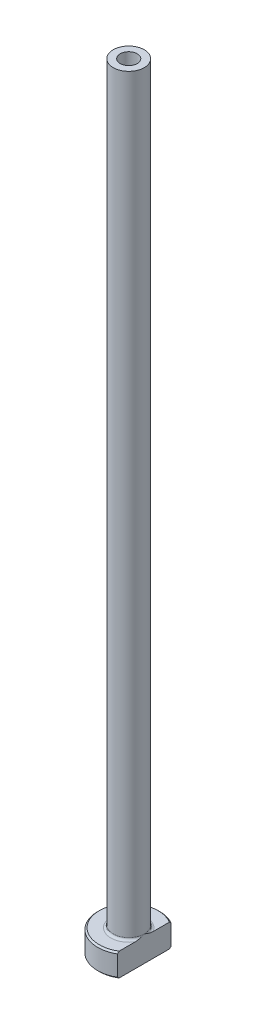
from build123d import *

# Parameters (mm, degrees)
FILLET1_R          = 0.3
CHAMFER1_SIZE      = 0.2
CUT_EXTRUDE1_DEPTH = 101.159872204
CHAMFER2_SIZE      = 0.5


with BuildPart() as part:
    # Sketch1 → Revolve1 (revolve)
    with BuildSketch(Plane.XY, mode=Mode.PRIVATE) as revolve1_sk:
        Polygon((-1.1, 100), (-2, 100), (-2, 3), (-4, 3), (-4, 0), (-1.35, 0), (-1.35, 53), (-1.1, 65), align=None)
    revolve(revolve1_sk.sketch.rotate(Axis((0, 92.187680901, 0), (0, -1, 0)), 270), axis=Axis((0, 92.187680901, 0), (0, -1, 0)))

    # Fillet1
    fillet1_edges = [part.edges().sort_by_distance(p)[0] for p in [
        (0, 3, -2),
    ]]
    fillet(fillet1_edges, radius=FILLET1_R)

    # Chamfer1
    chamfer1_edges = [part.edges().sort_by_distance(p)[0] for p in [
        (0, 0, -4),
        (0, 3, -4),
    ]]
    chamfer(chamfer1_edges, length=CHAMFER1_SIZE)

    # Sketch2 → Cut-Extrude1 (cut, through all)
    with BuildSketch(Plane.XZ):
        with BuildLine():
            Line((2, 3.464101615), (2, -3.464101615))
            ThreePointArc((2, -3.464101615), (4, 0), (2, 3.464101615))
        make_face()
    extrude(amount=-CUT_EXTRUDE1_DEPTH, mode=Mode.SUBTRACT)

    # Chamfer2
    chamfer2_edges = [part.edges().sort_by_distance(p)[0] for p in [
        (0, 0, -1.35),
    ]]
    chamfer(chamfer2_edges, length=CHAMFER2_SIZE)


solid = part.part
